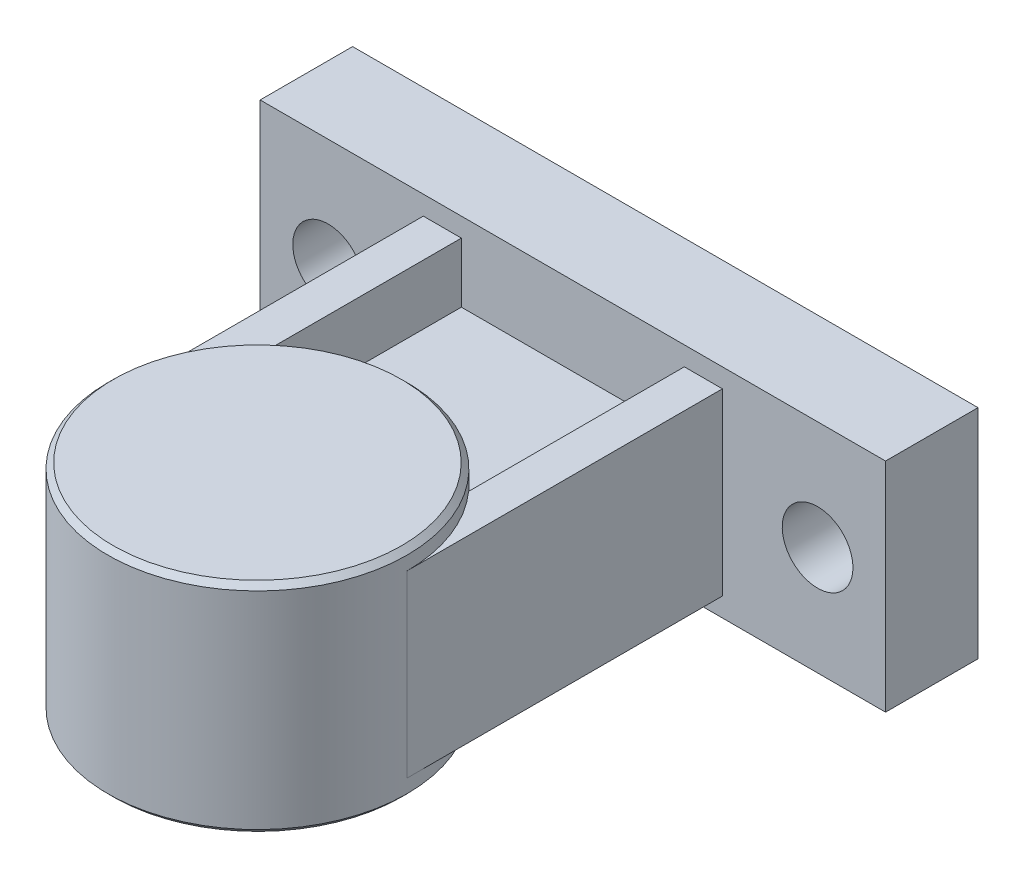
ISO-10303-21;
HEADER;
FILE_DESCRIPTION(('STEP AP214'),'2;1');
FILE_NAME('part.step','',(''),(''),'','','');
FILE_SCHEMA(('AUTOMOTIVE_DESIGN { 1 0 10303 214 1 1 1 1 }'));
ENDSEC;
DATA;
#1=APPLICATION_CONTEXT('core data for automotive mechanical design processes');
#2=APPLICATION_PROTOCOL_DEFINITION('international standard','automotive_design',2000,#1);
#3=PRODUCT_CONTEXT('',#1,'mechanical');
#4=PRODUCT('Part','Part','',(#3));
#5=PRODUCT_RELATED_PRODUCT_CATEGORY('part','',(#4));
#6=PRODUCT_DEFINITION_FORMATION('','',#4);
#7=PRODUCT_DEFINITION_CONTEXT('part definition',#1,'design');
#8=PRODUCT_DEFINITION('design','',#6,#7);
#9=PRODUCT_DEFINITION_SHAPE('','',#8);
#10=(LENGTH_UNIT() NAMED_UNIT(*) SI_UNIT(.MILLI.,.METRE.));
#11=(NAMED_UNIT(*) PLANE_ANGLE_UNIT() SI_UNIT($,.RADIAN.));
#12=(NAMED_UNIT(*) SI_UNIT($,.STERADIAN.) SOLID_ANGLE_UNIT());
#13=UNCERTAINTY_MEASURE_WITH_UNIT(LENGTH_MEASURE(1.E-05),#10,'distance_accuracy_value','');
#14=(GEOMETRIC_REPRESENTATION_CONTEXT(3) GLOBAL_UNCERTAINTY_ASSIGNED_CONTEXT((#13)) GLOBAL_UNIT_ASSIGNED_CONTEXT((#10,
#11,#12)) REPRESENTATION_CONTEXT('',''));
#15=CARTESIAN_POINT('',(0.,0.,0.));
#16=DIRECTION('',(0.,0.,1.));
#17=DIRECTION('',(1.,0.,0.));
#18=AXIS2_PLACEMENT_3D('',#15,#16,#17);
#19=CARTESIAN_POINT('',(72.5,16.5,75.));
#20=DIRECTION('',(0.,1.,0.));
#21=DIRECTION('',(-1.,0.,0.));
#22=AXIS2_PLACEMENT_3D('',#19,#20,#21);
#23=PLANE('',#22);
#24=CARTESIAN_POINT('',(45.,16.5,75.));
#25=DIRECTION('',(0.,1.,0.));
#26=DIRECTION('',(-1.,0.,0.));
#27=AXIS2_PLACEMENT_3D('',#24,#25,#26);
#28=CIRCLE('',#27,27.5);
#29=CARTESIAN_POINT('',(24.5,16.5,56.6696972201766));
#30=VERTEX_POINT('',#29);
#31=CARTESIAN_POINT('',(17.5,16.5,75.));
#32=VERTEX_POINT('',#31);
#33=EDGE_CURVE('E283',#30,#32,#28,.T.);
#34=ORIENTED_EDGE('',*,*,#33,.F.);
#35=DIRECTION('',(0.,0.,-1.));
#36=VECTOR('',#35,1.);
#37=CARTESIAN_POINT('',(24.5,16.5,56.6696972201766));
#38=LINE('',#37,#36);
#39=CARTESIAN_POINT('',(24.5,16.5,17.));
#40=VERTEX_POINT('',#39);
#41=EDGE_CURVE('E29',#30,#40,#38,.T.);
#42=ORIENTED_EDGE('',*,*,#41,.T.);
#43=DIRECTION('',(-1.,0.,0.));
#44=VECTOR('',#43,1.);
#45=CARTESIAN_POINT('',(72.5,16.5,17.));
#46=LINE('',#45,#44);
#47=CARTESIAN_POINT('',(17.5,16.5,17.));
#48=VERTEX_POINT('',#47);
#49=EDGE_CURVE('E154',#40,#48,#46,.T.);
#50=ORIENTED_EDGE('',*,*,#49,.T.);
#51=DIRECTION('',(0.,0.,-1.));
#52=VECTOR('',#51,1.);
#53=CARTESIAN_POINT('',(17.5,16.5,75.));
#54=LINE('',#53,#52);
#55=EDGE_CURVE('E275',#32,#48,#54,.T.);
#56=ORIENTED_EDGE('',*,*,#55,.F.);
#57=EDGE_LOOP('',(#34,#42,#50,#56));
#58=FACE_BOUND('',#57,.T.);
#59=ADVANCED_FACE('F14',(#58),#23,.T.);
#60=CARTESIAN_POINT('',(72.5,-16.5,75.));
#61=DIRECTION('',(0.,1.,0.));
#62=DIRECTION('',(0.,0.,1.));
#63=AXIS2_PLACEMENT_3D('',#60,#61,#62);
#64=PLANE('',#63);
#65=DIRECTION('',(0.,0.,-1.));
#66=VECTOR('',#65,1.);
#67=CARTESIAN_POINT('',(65.5,-16.5,56.6696972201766));
#68=LINE('',#67,#66);
#69=CARTESIAN_POINT('',(65.5,-16.5,56.6696972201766));
#70=VERTEX_POINT('',#69);
#71=CARTESIAN_POINT('',(65.5,-16.5,17.));
#72=VERTEX_POINT('',#71);
#73=EDGE_CURVE('E37',#70,#72,#68,.T.);
#74=ORIENTED_EDGE('',*,*,#73,.T.);
#75=DIRECTION('',(-1.,0.,0.));
#76=VECTOR('',#75,1.);
#77=CARTESIAN_POINT('',(72.5,-16.5,17.));
#78=LINE('',#77,#76);
#79=CARTESIAN_POINT('',(72.5,-16.5,17.));
#80=VERTEX_POINT('',#79);
#81=EDGE_CURVE('E156',#80,#72,#78,.T.);
#82=ORIENTED_EDGE('',*,*,#81,.F.);
#83=DIRECTION('',(0.,0.,-1.));
#84=VECTOR('',#83,1.);
#85=CARTESIAN_POINT('',(72.5,-16.5,75.));
#86=LINE('',#85,#84);
#87=CARTESIAN_POINT('',(72.5,-16.5,75.));
#88=VERTEX_POINT('',#87);
#89=EDGE_CURVE('E158',#88,#80,#86,.T.);
#90=ORIENTED_EDGE('',*,*,#89,.F.);
#91=CARTESIAN_POINT('',(45.,-16.5,75.));
#92=DIRECTION('',(0.,1.,0.));
#93=DIRECTION('',(0.,0.,1.));
#94=AXIS2_PLACEMENT_3D('',#91,#92,#93);
#95=CIRCLE('',#94,27.5);
#96=EDGE_CURVE('E281',#88,#70,#95,.T.);
#97=ORIENTED_EDGE('',*,*,#96,.T.);
#98=EDGE_LOOP('',(#74,#82,#90,#97));
#99=FACE_BOUND('',#98,.T.);
#100=ADVANCED_FACE('F240',(#99),#64,.F.);
#101=CARTESIAN_POINT('',(-12.5,20.,17.));
#102=DIRECTION('',(0.,0.,1.));
#103=DIRECTION('',(0.,-1.,0.));
#104=AXIS2_PLACEMENT_3D('',#101,#102,#103);
#105=PLANE('',#104);
#106=CARTESIAN_POINT('',(72.5,16.5,17.));
#107=VERTEX_POINT('',#106);
#108=CARTESIAN_POINT('',(65.5,16.5,17.));
#109=VERTEX_POINT('',#108);
#110=EDGE_CURVE('E133',#107,#109,#46,.T.);
#111=ORIENTED_EDGE('',*,*,#110,.F.);
#112=DIRECTION('',(0.,1.,0.));
#113=VECTOR('',#112,1.);
#114=CARTESIAN_POINT('',(72.5,-16.5,17.));
#115=LINE('',#114,#113);
#116=EDGE_CURVE('E293',#80,#107,#115,.T.);
#117=ORIENTED_EDGE('',*,*,#116,.F.);
#118=ORIENTED_EDGE('',*,*,#81,.T.);
#119=DIRECTION('',(0.,-1.,0.));
#120=VECTOR('',#119,1.);
#121=CARTESIAN_POINT('',(65.5,-5.5,17.));
#122=LINE('',#121,#120);
#123=CARTESIAN_POINT('',(65.5,-5.5,17.));
#124=VERTEX_POINT('',#123);
#125=EDGE_CURVE('E299',#124,#72,#122,.T.);
#126=ORIENTED_EDGE('',*,*,#125,.F.);
#127=DIRECTION('',(-1.,0.,0.));
#128=VECTOR('',#127,1.);
#129=CARTESIAN_POINT('',(65.5,-5.5,17.));
#130=LINE('',#129,#128);
#131=CARTESIAN_POINT('',(24.5,-5.5,17.));
#132=VERTEX_POINT('',#131);
#133=EDGE_CURVE('E301',#124,#132,#130,.T.);
#134=ORIENTED_EDGE('',*,*,#133,.T.);
#135=DIRECTION('',(0.,-1.,0.));
#136=VECTOR('',#135,1.);
#137=CARTESIAN_POINT('',(24.5,-5.5,17.));
#138=LINE('',#137,#136);
#139=CARTESIAN_POINT('',(24.5,-16.5,17.));
#140=VERTEX_POINT('',#139);
#141=EDGE_CURVE('E321',#132,#140,#138,.T.);
#142=ORIENTED_EDGE('',*,*,#141,.T.);
#143=CARTESIAN_POINT('',(17.5,-16.5,17.));
#144=VERTEX_POINT('',#143);
#145=EDGE_CURVE('E153',#140,#144,#78,.T.);
#146=ORIENTED_EDGE('',*,*,#145,.T.);
#147=DIRECTION('',(0.,1.,0.));
#148=VECTOR('',#147,1.);
#149=CARTESIAN_POINT('',(17.5,-16.5,17.));
#150=LINE('',#149,#148);
#151=EDGE_CURVE('E285',#144,#48,#150,.T.);
#152=ORIENTED_EDGE('',*,*,#151,.T.);
#153=ORIENTED_EDGE('',*,*,#49,.F.);
#154=DIRECTION('',(0.,1.,0.));
#155=VECTOR('',#154,1.);
#156=CARTESIAN_POINT('',(24.5,5.5,17.));
#157=LINE('',#156,#155);
#158=CARTESIAN_POINT('',(24.5,5.5,17.));
#159=VERTEX_POINT('',#158);
#160=EDGE_CURVE('E348',#159,#40,#157,.T.);
#161=ORIENTED_EDGE('',*,*,#160,.F.);
#162=DIRECTION('',(-1.,0.,0.));
#163=VECTOR('',#162,1.);
#164=CARTESIAN_POINT('',(65.5,5.5,17.));
#165=LINE('',#164,#163);
#166=CARTESIAN_POINT('',(65.5,5.5,17.));
#167=VERTEX_POINT('',#166);
#168=EDGE_CURVE('E135',#167,#159,#165,.T.);
#169=ORIENTED_EDGE('',*,*,#168,.F.);
#170=DIRECTION('',(0.,1.,0.));
#171=VECTOR('',#170,1.);
#172=CARTESIAN_POINT('',(65.5,5.5,17.));
#173=LINE('',#172,#171);
#174=EDGE_CURVE('E127',#167,#109,#173,.T.);
#175=ORIENTED_EDGE('',*,*,#174,.T.);
#176=EDGE_LOOP('',(#111,#117,#118,#126,#134,#142,#146,#152,#153,#161,#169,#175));
#177=FACE_BOUND('',#176,.T.);
#178=CARTESIAN_POINT('',(90.,0.,17.));
#179=DIRECTION('',(0.,0.,-1.));
#180=DIRECTION('',(0.,1.,0.));
#181=AXIS2_PLACEMENT_3D('',#178,#179,#180);
#182=CIRCLE('',#181,6.5);
#183=CARTESIAN_POINT('',(90.,6.5,17.));
#184=VERTEX_POINT('',#183);
#185=EDGE_CURVE('E166',#184,#184,#182,.T.);
#186=ORIENTED_EDGE('',*,*,#185,.T.);
#187=EDGE_LOOP('',(#186));
#188=FACE_BOUND('',#187,.T.);
#189=DIRECTION('',(0.,-1.,0.));
#190=VECTOR('',#189,1.);
#191=CARTESIAN_POINT('',(-12.5,20.,17.));
#192=LINE('',#191,#190);
#193=CARTESIAN_POINT('',(-12.5,20.,17.));
#194=VERTEX_POINT('',#193);
#195=CARTESIAN_POINT('',(-12.5,-20.,17.));
#196=VERTEX_POINT('',#195);
#197=EDGE_CURVE('E187',#194,#196,#192,.T.);
#198=ORIENTED_EDGE('',*,*,#197,.T.);
#199=DIRECTION('',(-1.,0.,0.));
#200=VECTOR('',#199,1.);
#201=CARTESIAN_POINT('',(102.5,-20.,17.));
#202=LINE('',#201,#200);
#203=CARTESIAN_POINT('',(102.5,-20.,17.));
#204=VERTEX_POINT('',#203);
#205=EDGE_CURVE('E190',#204,#196,#202,.T.);
#206=ORIENTED_EDGE('',*,*,#205,.F.);
#207=DIRECTION('',(0.,1.,0.));
#208=VECTOR('',#207,1.);
#209=CARTESIAN_POINT('',(102.5,-20.,17.));
#210=LINE('',#209,#208);
#211=CARTESIAN_POINT('',(102.5,20.,17.));
#212=VERTEX_POINT('',#211);
#213=EDGE_CURVE('E193',#204,#212,#210,.T.);
#214=ORIENTED_EDGE('',*,*,#213,.T.);
#215=DIRECTION('',(1.,0.,0.));
#216=VECTOR('',#215,1.);
#217=CARTESIAN_POINT('',(-12.5,20.,17.));
#218=LINE('',#217,#216);
#219=EDGE_CURVE('E196',#194,#212,#218,.T.);
#220=ORIENTED_EDGE('',*,*,#219,.F.);
#221=EDGE_LOOP('',(#198,#206,#214,#220));
#222=FACE_BOUND('',#221,.T.);
#223=CARTESIAN_POINT('',(0.,0.,17.));
#224=DIRECTION('',(0.,0.,1.));
#225=DIRECTION('',(0.,-1.,0.));
#226=AXIS2_PLACEMENT_3D('',#223,#224,#225);
#227=CIRCLE('',#226,6.5);
#228=CARTESIAN_POINT('',(0.,-6.5,17.));
#229=VERTEX_POINT('',#228);
#230=EDGE_CURVE('E172',#229,#229,#227,.T.);
#231=ORIENTED_EDGE('',*,*,#230,.F.);
#232=EDGE_LOOP('',(#231));
#233=FACE_BOUND('',#232,.T.);
#234=ADVANCED_FACE('F129',(#177,#188,#222,#233),#105,.T.);
#235=CARTESIAN_POINT('',(-12.5,20.,0.));
#236=DIRECTION('',(0.,0.,1.));
#237=DIRECTION('',(0.,-1.,0.));
#238=AXIS2_PLACEMENT_3D('',#235,#236,#237);
#239=PLANE('',#238);
#240=CARTESIAN_POINT('',(90.,0.,0.));
#241=DIRECTION('',(0.,0.,-1.));
#242=DIRECTION('',(0.,1.,0.));
#243=AXIS2_PLACEMENT_3D('',#240,#241,#242);
#244=CIRCLE('',#243,6.5);
#245=CARTESIAN_POINT('',(90.,6.5,0.));
#246=VERTEX_POINT('',#245);
#247=EDGE_CURVE('E163',#246,#246,#244,.T.);
#248=ORIENTED_EDGE('',*,*,#247,.F.);
#249=EDGE_LOOP('',(#248));
#250=FACE_BOUND('',#249,.T.);
#251=DIRECTION('',(0.,-1.,0.));
#252=VECTOR('',#251,1.);
#253=CARTESIAN_POINT('',(-12.5,20.,0.));
#254=LINE('',#253,#252);
#255=CARTESIAN_POINT('',(-12.5,20.,0.));
#256=VERTEX_POINT('',#255);
#257=CARTESIAN_POINT('',(-12.5,-20.,0.));
#258=VERTEX_POINT('',#257);
#259=EDGE_CURVE('E175',#256,#258,#254,.T.);
#260=ORIENTED_EDGE('',*,*,#259,.F.);
#261=DIRECTION('',(1.,0.,0.));
#262=VECTOR('',#261,1.);
#263=CARTESIAN_POINT('',(-12.5,20.,0.));
#264=LINE('',#263,#262);
#265=CARTESIAN_POINT('',(102.5,20.,0.));
#266=VERTEX_POINT('',#265);
#267=EDGE_CURVE('E184',#256,#266,#264,.T.);
#268=ORIENTED_EDGE('',*,*,#267,.T.);
#269=DIRECTION('',(0.,1.,0.));
#270=VECTOR('',#269,1.);
#271=CARTESIAN_POINT('',(102.5,-20.,0.));
#272=LINE('',#271,#270);
#273=CARTESIAN_POINT('',(102.5,-20.,0.));
#274=VERTEX_POINT('',#273);
#275=EDGE_CURVE('E181',#274,#266,#272,.T.);
#276=ORIENTED_EDGE('',*,*,#275,.F.);
#277=DIRECTION('',(-1.,0.,0.));
#278=VECTOR('',#277,1.);
#279=CARTESIAN_POINT('',(102.5,-20.,0.));
#280=LINE('',#279,#278);
#281=EDGE_CURVE('E178',#274,#258,#280,.T.);
#282=ORIENTED_EDGE('',*,*,#281,.T.);
#283=EDGE_LOOP('',(#260,#268,#276,#282));
#284=FACE_BOUND('',#283,.T.);
#285=CARTESIAN_POINT('',(0.,0.,0.));
#286=DIRECTION('',(0.,0.,1.));
#287=DIRECTION('',(0.,-1.,0.));
#288=AXIS2_PLACEMENT_3D('',#285,#286,#287);
#289=CIRCLE('',#288,6.5);
#290=CARTESIAN_POINT('',(0.,-6.5,0.));
#291=VERTEX_POINT('',#290);
#292=EDGE_CURVE('E169',#291,#291,#289,.T.);
#293=ORIENTED_EDGE('',*,*,#292,.T.);
#294=EDGE_LOOP('',(#293));
#295=FACE_BOUND('',#294,.T.);
#296=ADVANCED_FACE('F479',(#250,#284,#295),#239,.F.);
#297=CARTESIAN_POINT('',(-12.5,20.,17.));
#298=DIRECTION('',(1.,0.,0.));
#299=DIRECTION('',(0.,1.,0.));
#300=AXIS2_PLACEMENT_3D('',#297,#298,#299);
#301=PLANE('',#300);
#302=DIRECTION('',(0.,0.,-1.));
#303=VECTOR('',#302,1.);
#304=CARTESIAN_POINT('',(-12.5,-20.,17.));
#305=LINE('',#304,#303);
#306=EDGE_CURVE('E205',#196,#258,#305,.T.);
#307=ORIENTED_EDGE('',*,*,#306,.F.);
#308=ORIENTED_EDGE('',*,*,#197,.F.);
#309=DIRECTION('',(0.,0.,-1.));
#310=VECTOR('',#309,1.);
#311=CARTESIAN_POINT('',(-12.5,20.,17.));
#312=LINE('',#311,#310);
#313=EDGE_CURVE('E199',#194,#256,#312,.T.);
#314=ORIENTED_EDGE('',*,*,#313,.T.);
#315=ORIENTED_EDGE('',*,*,#259,.T.);
#316=EDGE_LOOP('',(#307,#308,#314,#315));
#317=FACE_BOUND('',#316,.T.);
#318=ADVANCED_FACE('F486',(#317),#301,.F.);
#319=CARTESIAN_POINT('',(102.5,-20.,17.));
#320=DIRECTION('',(0.,-1.,0.));
#321=DIRECTION('',(1.,0.,0.));
#322=AXIS2_PLACEMENT_3D('',#319,#320,#321);
#323=PLANE('',#322);
#324=DIRECTION('',(0.,0.,-1.));
#325=VECTOR('',#324,1.);
#326=CARTESIAN_POINT('',(102.5,-20.,17.));
#327=LINE('',#326,#325);
#328=EDGE_CURVE('E203',#204,#274,#327,.T.);
#329=ORIENTED_EDGE('',*,*,#328,.F.);
#330=ORIENTED_EDGE('',*,*,#205,.T.);
#331=ORIENTED_EDGE('',*,*,#306,.T.);
#332=ORIENTED_EDGE('',*,*,#281,.F.);
#333=EDGE_LOOP('',(#329,#330,#331,#332));
#334=FACE_BOUND('',#333,.T.);
#335=ADVANCED_FACE('F16',(#334),#323,.T.);
#336=CARTESIAN_POINT('',(102.5,-20.,17.));
#337=DIRECTION('',(-1.,0.,0.));
#338=DIRECTION('',(0.,-1.,0.));
#339=AXIS2_PLACEMENT_3D('',#336,#337,#338);
#340=PLANE('',#339);
#341=DIRECTION('',(0.,0.,-1.));
#342=VECTOR('',#341,1.);
#343=CARTESIAN_POINT('',(102.5,20.,17.));
#344=LINE('',#343,#342);
#345=EDGE_CURVE('E201',#212,#266,#344,.T.);
#346=ORIENTED_EDGE('',*,*,#345,.F.);
#347=ORIENTED_EDGE('',*,*,#213,.F.);
#348=ORIENTED_EDGE('',*,*,#328,.T.);
#349=ORIENTED_EDGE('',*,*,#275,.T.);
#350=EDGE_LOOP('',(#346,#347,#348,#349));
#351=FACE_BOUND('',#350,.T.);
#352=ADVANCED_FACE('F503',(#351),#340,.F.);
#353=CARTESIAN_POINT('',(-12.5,20.,17.));
#354=DIRECTION('',(0.,1.,0.));
#355=DIRECTION('',(-1.,0.,0.));
#356=AXIS2_PLACEMENT_3D('',#353,#354,#355);
#357=PLANE('',#356);
#358=ORIENTED_EDGE('',*,*,#219,.T.);
#359=ORIENTED_EDGE('',*,*,#345,.T.);
#360=ORIENTED_EDGE('',*,*,#267,.F.);
#361=ORIENTED_EDGE('',*,*,#313,.F.);
#362=EDGE_LOOP('',(#358,#359,#360,#361));
#363=FACE_BOUND('',#362,.T.);
#364=ADVANCED_FACE('F511',(#363),#357,.T.);
#365=CARTESIAN_POINT('',(0.,0.,17.));
#366=DIRECTION('',(0.,0.,-1.));
#367=DIRECTION('',(0.,1.,0.));
#368=AXIS2_PLACEMENT_3D('',#365,#366,#367);
#369=CYLINDRICAL_SURFACE('',#368,6.5);
#370=ORIENTED_EDGE('',*,*,#230,.T.);
#371=EDGE_LOOP('',(#370));
#372=FACE_BOUND('',#371,.T.);
#373=ORIENTED_EDGE('',*,*,#292,.F.);
#374=EDGE_LOOP('',(#373));
#375=FACE_BOUND('',#374,.T.);
#376=ADVANCED_FACE('F519',(#372,#375),#369,.F.);
#377=CARTESIAN_POINT('',(90.,0.,17.));
#378=DIRECTION('',(0.,0.,-1.));
#379=DIRECTION('',(0.,1.,0.));
#380=AXIS2_PLACEMENT_3D('',#377,#378,#379);
#381=CYLINDRICAL_SURFACE('',#380,6.5);
#382=ORIENTED_EDGE('',*,*,#185,.F.);
#383=EDGE_LOOP('',(#382));
#384=FACE_BOUND('',#383,.T.);
#385=ORIENTED_EDGE('',*,*,#247,.T.);
#386=EDGE_LOOP('',(#385));
#387=FACE_BOUND('',#386,.T.);
#388=ADVANCED_FACE('F260',(#384,#387),#381,.F.);
#389=ORIENTED_EDGE('',*,*,#145,.F.);
#390=DIRECTION('',(0.,0.,-1.));
#391=VECTOR('',#390,1.);
#392=CARTESIAN_POINT('',(24.5,-16.5,56.6696972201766));
#393=LINE('',#392,#391);
#394=CARTESIAN_POINT('',(24.5,-16.5,56.6696972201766));
#395=VERTEX_POINT('',#394);
#396=EDGE_CURVE('E139',#395,#140,#393,.T.);
#397=ORIENTED_EDGE('',*,*,#396,.F.);
#398=CARTESIAN_POINT('',(17.5,-16.5,75.));
#399=VERTEX_POINT('',#398);
#400=EDGE_CURVE('E324',#395,#399,#95,.T.);
#401=ORIENTED_EDGE('',*,*,#400,.T.);
#402=DIRECTION('',(0.,0.,-1.));
#403=VECTOR('',#402,1.);
#404=CARTESIAN_POINT('',(17.5,-16.5,75.));
#405=LINE('',#404,#403);
#406=EDGE_CURVE('E278',#399,#144,#405,.T.);
#407=ORIENTED_EDGE('',*,*,#406,.T.);
#408=EDGE_LOOP('',(#389,#397,#401,#407));
#409=FACE_BOUND('',#408,.T.);
#410=ADVANCED_FACE('F249',(#409),#64,.F.);
#411=DIRECTION('',(0.,0.,-1.));
#412=VECTOR('',#411,1.);
#413=CARTESIAN_POINT('',(65.5,16.5,56.6696972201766));
#414=LINE('',#413,#412);
#415=CARTESIAN_POINT('',(65.5,16.5,56.6696972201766));
#416=VERTEX_POINT('',#415);
#417=EDGE_CURVE('E143',#416,#109,#414,.T.);
#418=ORIENTED_EDGE('',*,*,#417,.F.);
#419=CARTESIAN_POINT('',(72.5,16.5,75.));
#420=VERTEX_POINT('',#419);
#421=EDGE_CURVE('E323',#420,#416,#28,.T.);
#422=ORIENTED_EDGE('',*,*,#421,.F.);
#423=DIRECTION('',(0.,0.,-1.));
#424=VECTOR('',#423,1.);
#425=CARTESIAN_POINT('',(72.5,16.5,75.));
#426=LINE('',#425,#424);
#427=EDGE_CURVE('E151',#420,#107,#426,.T.);
#428=ORIENTED_EDGE('',*,*,#427,.T.);
#429=ORIENTED_EDGE('',*,*,#110,.T.);
#430=EDGE_LOOP('',(#418,#422,#428,#429));
#431=FACE_BOUND('',#430,.T.);
#432=ADVANCED_FACE('F149',(#431),#23,.T.);
#433=CARTESIAN_POINT('',(72.5,16.5,75.));
#434=DIRECTION('',(-1.,0.,0.));
#435=DIRECTION('',(0.,-1.,0.));
#436=AXIS2_PLACEMENT_3D('',#433,#434,#435);
#437=PLANE('',#436);
#438=DIRECTION('',(0.,1.,0.));
#439=VECTOR('',#438,1.);
#440=CARTESIAN_POINT('',(72.5,-16.5,75.));
#441=LINE('',#440,#439);
#442=EDGE_CURVE('E291',#88,#420,#441,.T.);
#443=ORIENTED_EDGE('',*,*,#442,.F.);
#444=ORIENTED_EDGE('',*,*,#89,.T.);
#445=ORIENTED_EDGE('',*,*,#116,.T.);
#446=ORIENTED_EDGE('',*,*,#427,.F.);
#447=EDGE_LOOP('',(#443,#444,#445,#446));
#448=FACE_BOUND('',#447,.T.);
#449=ADVANCED_FACE('F253',(#448),#437,.F.);
#450=CARTESIAN_POINT('',(17.5,16.5,75.));
#451=DIRECTION('',(-1.,0.,0.));
#452=DIRECTION('',(0.,-1.,0.));
#453=AXIS2_PLACEMENT_3D('',#450,#451,#452);
#454=PLANE('',#453);
#455=DIRECTION('',(0.,1.,0.));
#456=VECTOR('',#455,1.);
#457=CARTESIAN_POINT('',(17.5,-16.5,75.));
#458=LINE('',#457,#456);
#459=EDGE_CURVE('E272',#399,#32,#458,.T.);
#460=ORIENTED_EDGE('',*,*,#459,.T.);
#461=ORIENTED_EDGE('',*,*,#55,.T.);
#462=ORIENTED_EDGE('',*,*,#151,.F.);
#463=ORIENTED_EDGE('',*,*,#406,.F.);
#464=EDGE_LOOP('',(#460,#461,#462,#463));
#465=FACE_BOUND('',#464,.T.);
#466=ADVANCED_FACE('F236',(#465),#454,.T.);
#467=CARTESIAN_POINT('',(45.,20.,75.));
#468=DIRECTION('',(0.,-1.,0.));
#469=DIRECTION('',(1.,0.,0.));
#470=AXIS2_PLACEMENT_3D('',#467,#468,#469);
#471=CYLINDRICAL_SURFACE('',#470,27.5);
#472=CARTESIAN_POINT('',(45.,-19.,75.));
#473=DIRECTION('',(0.,-1.,0.));
#474=DIRECTION('',(1.,0.,0.));
#475=AXIS2_PLACEMENT_3D('',#472,#473,#474);
#476=CIRCLE('',#475,27.5);
#477=CARTESIAN_POINT('',(72.5,-19.,75.));
#478=VERTEX_POINT('',#477);
#479=EDGE_CURVE('E22',#478,#478,#476,.F.);
#480=ORIENTED_EDGE('',*,*,#479,.T.);
#481=EDGE_LOOP('',(#480));
#482=FACE_BOUND('',#481,.T.);
#483=CARTESIAN_POINT('',(45.,19.,75.));
#484=DIRECTION('',(0.,-1.,0.));
#485=DIRECTION('',(1.,0.,0.));
#486=AXIS2_PLACEMENT_3D('',#483,#484,#485);
#487=CIRCLE('',#486,27.5);
#488=CARTESIAN_POINT('',(72.5,19.,75.));
#489=VERTEX_POINT('',#488);
#490=EDGE_CURVE('E210',#489,#489,#487,.T.);
#491=ORIENTED_EDGE('',*,*,#490,.T.);
#492=EDGE_LOOP('',(#491));
#493=FACE_BOUND('',#492,.T.);
#494=ORIENTED_EDGE('',*,*,#96,.F.);
#495=ORIENTED_EDGE('',*,*,#442,.T.);
#496=ORIENTED_EDGE('',*,*,#421,.T.);
#497=DIRECTION('',(0.,1.,0.));
#498=VECTOR('',#497,1.);
#499=CARTESIAN_POINT('',(65.5,5.5,56.6696972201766));
#500=LINE('',#499,#498);
#501=CARTESIAN_POINT('',(65.5,5.5,56.6696972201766));
#502=VERTEX_POINT('',#501);
#503=EDGE_CURVE('E140',#502,#416,#500,.T.);
#504=ORIENTED_EDGE('',*,*,#503,.F.);
#505=CARTESIAN_POINT('',(45.,5.5,75.));
#506=DIRECTION('',(0.,-1.,0.));
#507=DIRECTION('',(1.,0.,0.));
#508=AXIS2_PLACEMENT_3D('',#505,#506,#507);
#509=CIRCLE('',#508,27.5);
#510=CARTESIAN_POINT('',(24.5,5.5,56.6696972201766));
#511=VERTEX_POINT('',#510);
#512=EDGE_CURVE('E337',#511,#502,#509,.T.);
#513=ORIENTED_EDGE('',*,*,#512,.F.);
#514=DIRECTION('',(0.,1.,0.));
#515=VECTOR('',#514,1.);
#516=CARTESIAN_POINT('',(24.5,5.5,56.6696972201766));
#517=LINE('',#516,#515);
#518=EDGE_CURVE('E339',#511,#30,#517,.T.);
#519=ORIENTED_EDGE('',*,*,#518,.T.);
#520=ORIENTED_EDGE('',*,*,#33,.T.);
#521=ORIENTED_EDGE('',*,*,#459,.F.);
#522=ORIENTED_EDGE('',*,*,#400,.F.);
#523=DIRECTION('',(0.,-1.,0.));
#524=VECTOR('',#523,1.);
#525=CARTESIAN_POINT('',(24.5,-5.5,56.6696972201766));
#526=LINE('',#525,#524);
#527=CARTESIAN_POINT('',(24.5,-5.5,56.6696972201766));
#528=VERTEX_POINT('',#527);
#529=EDGE_CURVE('E319',#528,#395,#526,.T.);
#530=ORIENTED_EDGE('',*,*,#529,.F.);
#531=CARTESIAN_POINT('',(45.,-5.5,75.));
#532=DIRECTION('',(0.,-1.,0.));
#533=DIRECTION('',(1.,0.,0.));
#534=AXIS2_PLACEMENT_3D('',#531,#532,#533);
#535=CIRCLE('',#534,27.5);
#536=CARTESIAN_POINT('',(65.5,-5.5,56.6696972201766));
#537=VERTEX_POINT('',#536);
#538=EDGE_CURVE('E310',#528,#537,#535,.T.);
#539=ORIENTED_EDGE('',*,*,#538,.T.);
#540=DIRECTION('',(0.,-1.,0.));
#541=VECTOR('',#540,1.);
#542=CARTESIAN_POINT('',(65.5,-5.5,56.6696972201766));
#543=LINE('',#542,#541);
#544=EDGE_CURVE('E317',#537,#70,#543,.T.);
#545=ORIENTED_EDGE('',*,*,#544,.T.);
#546=EDGE_LOOP('',(#494,#495,#496,#504,#513,#519,#520,#521,#522,#530,#539,#545));
#547=FACE_BOUND('',#546,.T.);
#548=ADVANCED_FACE('F215',(#482,#493,#547),#471,.T.);
#549=CARTESIAN_POINT('',(45.,20.,75.));
#550=DIRECTION('',(0.,-1.,0.));
#551=DIRECTION('',(1.,0.,0.));
#552=AXIS2_PLACEMENT_3D('',#549,#550,#551);
#553=PLANE('',#552);
#554=CARTESIAN_POINT('',(45.,20.,75.));
#555=DIRECTION('',(0.,-1.,0.));
#556=DIRECTION('',(1.,0.,0.));
#557=AXIS2_PLACEMENT_3D('',#554,#555,#556);
#558=CIRCLE('',#557,26.5);
#559=CARTESIAN_POINT('',(71.5,20.,75.));
#560=VERTEX_POINT('',#559);
#561=EDGE_CURVE('E9',#560,#560,#558,.F.);
#562=ORIENTED_EDGE('',*,*,#561,.T.);
#563=EDGE_LOOP('',(#562));
#564=FACE_BOUND('',#563,.T.);
#565=ADVANCED_FACE('F227',(#564),#553,.F.);
#566=CARTESIAN_POINT('',(45.,-20.,75.));
#567=DIRECTION('',(0.,-1.,0.));
#568=DIRECTION('',(1.,0.,0.));
#569=AXIS2_PLACEMENT_3D('',#566,#567,#568);
#570=PLANE('',#569);
#571=CARTESIAN_POINT('',(45.,-20.,75.));
#572=DIRECTION('',(0.,-1.,0.));
#573=DIRECTION('',(1.,0.,0.));
#574=AXIS2_PLACEMENT_3D('',#571,#572,#573);
#575=CIRCLE('',#574,26.5);
#576=CARTESIAN_POINT('',(71.5,-20.,75.));
#577=VERTEX_POINT('',#576);
#578=EDGE_CURVE('E207',#577,#577,#575,.T.);
#579=ORIENTED_EDGE('',*,*,#578,.T.);
#580=EDGE_LOOP('',(#579));
#581=FACE_BOUND('',#580,.T.);
#582=ADVANCED_FACE('F222',(#581),#570,.T.);
#583=CARTESIAN_POINT('',(45.,-20.,75.));
#584=DIRECTION('',(0.,1.,0.));
#585=DIRECTION('',(-1.,0.,0.));
#586=AXIS2_PLACEMENT_3D('',#583,#584,#585);
#587=CONICAL_SURFACE('',#586,26.5,0.785398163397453);
#588=ORIENTED_EDGE('',*,*,#479,.F.);
#589=EDGE_LOOP('',(#588));
#590=FACE_BOUND('',#589,.T.);
#591=ORIENTED_EDGE('',*,*,#578,.F.);
#592=EDGE_LOOP('',(#591));
#593=FACE_BOUND('',#592,.T.);
#594=ADVANCED_FACE('F218',(#590,#593),#587,.T.);
#595=CARTESIAN_POINT('',(45.,19.,75.));
#596=DIRECTION('',(0.,-1.,0.));
#597=DIRECTION('',(1.,0.,0.));
#598=AXIS2_PLACEMENT_3D('',#595,#596,#597);
#599=CONICAL_SURFACE('',#598,27.5,0.785398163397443);
#600=ORIENTED_EDGE('',*,*,#561,.F.);
#601=EDGE_LOOP('',(#600));
#602=FACE_BOUND('',#601,.T.);
#603=ORIENTED_EDGE('',*,*,#490,.F.);
#604=EDGE_LOOP('',(#603));
#605=FACE_BOUND('',#604,.T.);
#606=ADVANCED_FACE('F221',(#602,#605),#599,.T.);
#607=CARTESIAN_POINT('',(24.5,-5.5,56.6696972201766));
#608=DIRECTION('',(-1.,0.,0.));
#609=DIRECTION('',(0.,0.,-1.));
#610=AXIS2_PLACEMENT_3D('',#607,#608,#609);
#611=PLANE('',#610);
#612=ORIENTED_EDGE('',*,*,#529,.T.);
#613=ORIENTED_EDGE('',*,*,#396,.T.);
#614=ORIENTED_EDGE('',*,*,#141,.F.);
#615=DIRECTION('',(0.,0.,-1.));
#616=VECTOR('',#615,1.);
#617=CARTESIAN_POINT('',(24.5,-5.5,56.6696972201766));
#618=LINE('',#617,#616);
#619=EDGE_CURVE('E303',#528,#132,#618,.T.);
#620=ORIENTED_EDGE('',*,*,#619,.F.);
#621=EDGE_LOOP('',(#612,#613,#614,#620));
#622=FACE_BOUND('',#621,.T.);
#623=ADVANCED_FACE('F331',(#622),#611,.F.);
#624=CARTESIAN_POINT('',(65.5,-5.5,56.6696972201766));
#625=DIRECTION('',(-1.,0.,0.));
#626=DIRECTION('',(0.,0.,-1.));
#627=AXIS2_PLACEMENT_3D('',#624,#625,#626);
#628=PLANE('',#627);
#629=DIRECTION('',(0.,0.,-1.));
#630=VECTOR('',#629,1.);
#631=CARTESIAN_POINT('',(65.5,-5.5,56.6696972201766));
#632=LINE('',#631,#630);
#633=EDGE_CURVE('E313',#537,#124,#632,.T.);
#634=ORIENTED_EDGE('',*,*,#633,.T.);
#635=ORIENTED_EDGE('',*,*,#125,.T.);
#636=ORIENTED_EDGE('',*,*,#73,.F.);
#637=ORIENTED_EDGE('',*,*,#544,.F.);
#638=EDGE_LOOP('',(#634,#635,#636,#637));
#639=FACE_BOUND('',#638,.T.);
#640=ADVANCED_FACE('F334',(#639),#628,.T.);
#641=CARTESIAN_POINT('',(45.,-5.5,75.));
#642=DIRECTION('',(0.,-1.,0.));
#643=DIRECTION('',(1.,0.,0.));
#644=AXIS2_PLACEMENT_3D('',#641,#642,#643);
#645=PLANE('',#644);
#646=ORIENTED_EDGE('',*,*,#133,.F.);
#647=ORIENTED_EDGE('',*,*,#633,.F.);
#648=ORIENTED_EDGE('',*,*,#538,.F.);
#649=ORIENTED_EDGE('',*,*,#619,.T.);
#650=EDGE_LOOP('',(#646,#647,#648,#649));
#651=FACE_BOUND('',#650,.T.);
#652=ADVANCED_FACE('F333',(#651),#645,.T.);
#653=CARTESIAN_POINT('',(65.5,5.5,56.6696972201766));
#654=DIRECTION('',(1.,0.,0.));
#655=DIRECTION('',(0.,0.,1.));
#656=AXIS2_PLACEMENT_3D('',#653,#654,#655);
#657=PLANE('',#656);
#658=ORIENTED_EDGE('',*,*,#503,.T.);
#659=ORIENTED_EDGE('',*,*,#417,.T.);
#660=ORIENTED_EDGE('',*,*,#174,.F.);
#661=DIRECTION('',(0.,0.,-1.));
#662=VECTOR('',#661,1.);
#663=CARTESIAN_POINT('',(65.5,5.5,56.6696972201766));
#664=LINE('',#663,#662);
#665=EDGE_CURVE('E341',#502,#167,#664,.T.);
#666=ORIENTED_EDGE('',*,*,#665,.F.);
#667=EDGE_LOOP('',(#658,#659,#660,#666));
#668=FACE_BOUND('',#667,.T.);
#669=ADVANCED_FACE('F144',(#668),#657,.F.);
#670=CARTESIAN_POINT('',(24.5,5.5,56.6696972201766));
#671=DIRECTION('',(1.,0.,0.));
#672=DIRECTION('',(0.,0.,1.));
#673=AXIS2_PLACEMENT_3D('',#670,#671,#672);
#674=PLANE('',#673);
#675=DIRECTION('',(0.,0.,-1.));
#676=VECTOR('',#675,1.);
#677=CARTESIAN_POINT('',(24.5,5.5,56.6696972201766));
#678=LINE('',#677,#676);
#679=EDGE_CURVE('E346',#511,#159,#678,.T.);
#680=ORIENTED_EDGE('',*,*,#679,.T.);
#681=ORIENTED_EDGE('',*,*,#160,.T.);
#682=ORIENTED_EDGE('',*,*,#41,.F.);
#683=ORIENTED_EDGE('',*,*,#518,.F.);
#684=EDGE_LOOP('',(#680,#681,#682,#683));
#685=FACE_BOUND('',#684,.T.);
#686=ADVANCED_FACE('F353',(#685),#674,.T.);
#687=CARTESIAN_POINT('',(45.,5.5,75.));
#688=DIRECTION('',(0.,1.,0.));
#689=DIRECTION('',(1.,0.,0.));
#690=AXIS2_PLACEMENT_3D('',#687,#688,#689);
#691=PLANE('',#690);
#692=ORIENTED_EDGE('',*,*,#168,.T.);
#693=ORIENTED_EDGE('',*,*,#679,.F.);
#694=ORIENTED_EDGE('',*,*,#512,.T.);
#695=ORIENTED_EDGE('',*,*,#665,.T.);
#696=EDGE_LOOP('',(#692,#693,#694,#695));
#697=FACE_BOUND('',#696,.T.);
#698=ADVANCED_FACE('F344',(#697),#691,.T.);
#699=CLOSED_SHELL('',(#59,#100,#234,#296,#318,#335,#352,#364,#376,#388,#410,#432,#449,#466,#548,
#565,#582,#594,#606,#623,#640,#652,#669,#686,#698));
#700=MANIFOLD_SOLID_BREP('B1',#699);
#701=ADVANCED_BREP_SHAPE_REPRESENTATION('',(#18,#700),#14);
#702=SHAPE_DEFINITION_REPRESENTATION(#9,#701);
ENDSEC;
END-ISO-10303-21;
